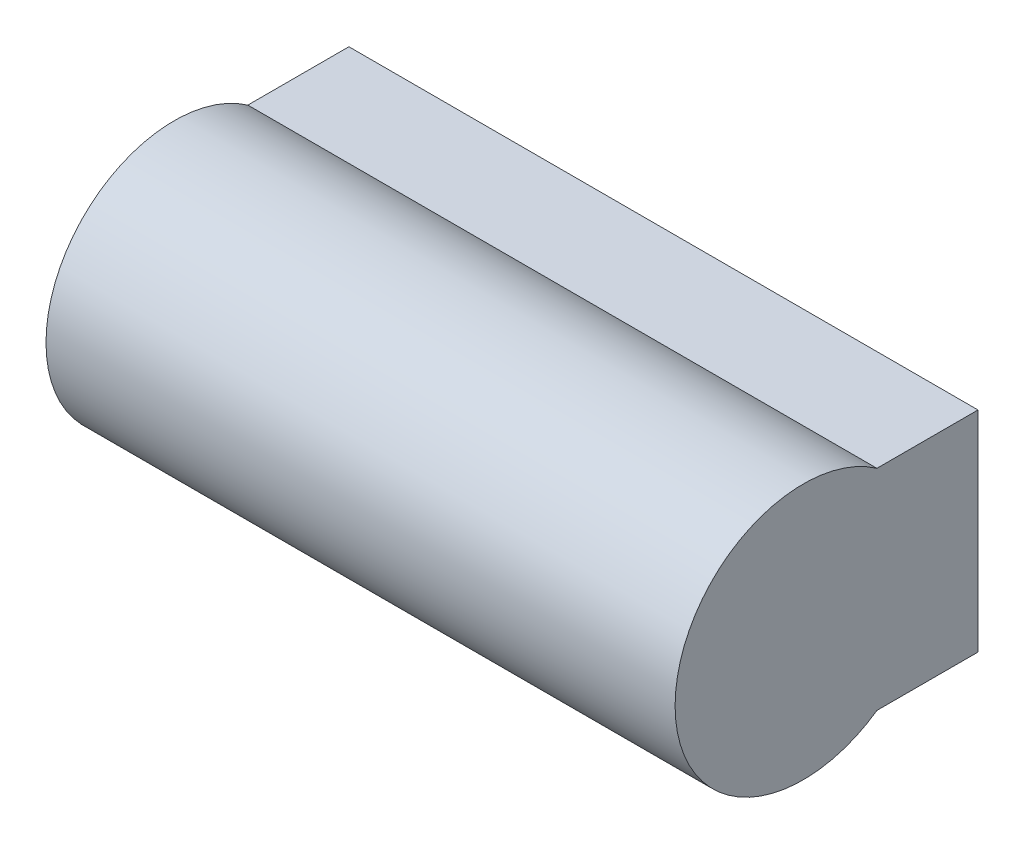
ISO-10303-21;
HEADER;
FILE_DESCRIPTION(('STEP AP214'),'2;1');
FILE_NAME('part.step','',(''),(''),'','','');
FILE_SCHEMA(('AUTOMOTIVE_DESIGN { 1 0 10303 214 1 1 1 1 }'));
ENDSEC;
DATA;
#1=APPLICATION_CONTEXT('core data for automotive mechanical design processes');
#2=APPLICATION_PROTOCOL_DEFINITION('international standard','automotive_design',2000,#1);
#3=PRODUCT_CONTEXT('',#1,'mechanical');
#4=PRODUCT('Part','Part','',(#3));
#5=PRODUCT_RELATED_PRODUCT_CATEGORY('part','',(#4));
#6=PRODUCT_DEFINITION_FORMATION('','',#4);
#7=PRODUCT_DEFINITION_CONTEXT('part definition',#1,'design');
#8=PRODUCT_DEFINITION('design','',#6,#7);
#9=PRODUCT_DEFINITION_SHAPE('','',#8);
#10=(LENGTH_UNIT() NAMED_UNIT(*) SI_UNIT(.MILLI.,.METRE.));
#11=(NAMED_UNIT(*) PLANE_ANGLE_UNIT() SI_UNIT($,.RADIAN.));
#12=(NAMED_UNIT(*) SI_UNIT($,.STERADIAN.) SOLID_ANGLE_UNIT());
#13=UNCERTAINTY_MEASURE_WITH_UNIT(LENGTH_MEASURE(1.E-05),#10,'distance_accuracy_value','');
#14=(GEOMETRIC_REPRESENTATION_CONTEXT(3) GLOBAL_UNCERTAINTY_ASSIGNED_CONTEXT((#13)) GLOBAL_UNIT_ASSIGNED_CONTEXT((#10,
#11,#12)) REPRESENTATION_CONTEXT('',''));
#15=CARTESIAN_POINT('',(0.,0.,0.));
#16=DIRECTION('',(0.,0.,1.));
#17=DIRECTION('',(1.,0.,0.));
#18=AXIS2_PLACEMENT_3D('',#15,#16,#17);
#19=CARTESIAN_POINT('',(21.,0.,7.5));
#20=DIRECTION('',(-1.,0.,0.));
#21=DIRECTION('',(0.,0.,1.));
#22=AXIS2_PLACEMENT_3D('',#19,#20,#21);
#23=CYLINDRICAL_SURFACE('',#22,5.5);
#24=DIRECTION('',(-1.,0.,0.));
#25=VECTOR('',#24,1.);
#26=CARTESIAN_POINT('',(21.,-4.5,4.33772233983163));
#27=LINE('',#26,#25);
#28=CARTESIAN_POINT('',(21.,-4.5,4.33772233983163));
#29=VERTEX_POINT('',#28);
#30=CARTESIAN_POINT('',(-6.,-4.5,4.33772233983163));
#31=VERTEX_POINT('',#30);
#32=EDGE_CURVE('E9',#29,#31,#27,.T.);
#33=ORIENTED_EDGE('',*,*,#32,.F.);
#34=CARTESIAN_POINT('',(21.,0.,7.5));
#35=DIRECTION('',(1.,0.,0.));
#36=DIRECTION('',(0.,0.,-1.));
#37=AXIS2_PLACEMENT_3D('',#34,#35,#36);
#38=CIRCLE('',#37,5.5);
#39=CARTESIAN_POINT('',(21.,4.5,4.33772233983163));
#40=VERTEX_POINT('',#39);
#41=EDGE_CURVE('E84',#40,#29,#38,.T.);
#42=ORIENTED_EDGE('',*,*,#41,.F.);
#43=DIRECTION('',(-1.,0.,0.));
#44=VECTOR('',#43,1.);
#45=CARTESIAN_POINT('',(21.,4.5,4.33772233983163));
#46=LINE('',#45,#44);
#47=CARTESIAN_POINT('',(-6.,4.5,4.33772233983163));
#48=VERTEX_POINT('',#47);
#49=EDGE_CURVE('E35',#40,#48,#46,.T.);
#50=ORIENTED_EDGE('',*,*,#49,.T.);
#51=CARTESIAN_POINT('',(-6.,0.,7.5));
#52=DIRECTION('',(1.,0.,0.));
#53=DIRECTION('',(0.,0.,-1.));
#54=AXIS2_PLACEMENT_3D('',#51,#52,#53);
#55=CIRCLE('',#54,5.5);
#56=EDGE_CURVE('E71',#48,#31,#55,.T.);
#57=ORIENTED_EDGE('',*,*,#56,.T.);
#58=EDGE_LOOP('',(#33,#42,#50,#57));
#59=FACE_BOUND('',#58,.T.);
#60=ADVANCED_FACE('F14',(#59),#23,.T.);
#61=CARTESIAN_POINT('',(21.,-4.5,4.33772233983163));
#62=DIRECTION('',(0.,1.,0.));
#63=DIRECTION('',(0.,0.,1.));
#64=AXIS2_PLACEMENT_3D('',#61,#62,#63);
#65=PLANE('',#64);
#66=DIRECTION('',(-1.,0.,0.));
#67=VECTOR('',#66,1.);
#68=CARTESIAN_POINT('',(21.,-4.5,0.));
#69=LINE('',#68,#67);
#70=CARTESIAN_POINT('',(21.,-4.5,0.));
#71=VERTEX_POINT('',#70);
#72=CARTESIAN_POINT('',(-6.,-4.5,0.));
#73=VERTEX_POINT('',#72);
#74=EDGE_CURVE('E28',#71,#73,#69,.T.);
#75=ORIENTED_EDGE('',*,*,#74,.F.);
#76=DIRECTION('',(0.,0.,-1.));
#77=VECTOR('',#76,1.);
#78=CARTESIAN_POINT('',(21.,-4.5,4.33772233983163));
#79=LINE('',#78,#77);
#80=EDGE_CURVE('E67',#29,#71,#79,.T.);
#81=ORIENTED_EDGE('',*,*,#80,.F.);
#82=ORIENTED_EDGE('',*,*,#32,.T.);
#83=DIRECTION('',(0.,0.,-1.));
#84=VECTOR('',#83,1.);
#85=CARTESIAN_POINT('',(-6.,-4.5,4.33772233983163));
#86=LINE('',#85,#84);
#87=EDGE_CURVE('E64',#31,#73,#86,.T.);
#88=ORIENTED_EDGE('',*,*,#87,.T.);
#89=EDGE_LOOP('',(#75,#81,#82,#88));
#90=FACE_BOUND('',#89,.T.);
#91=ADVANCED_FACE('F16',(#90),#65,.F.);
#92=CARTESIAN_POINT('',(21.,4.5,0.));
#93=DIRECTION('',(0.,0.,-1.));
#94=DIRECTION('',(0.,1.,0.));
#95=AXIS2_PLACEMENT_3D('',#92,#93,#94);
#96=PLANE('',#95);
#97=CARTESIAN_POINT('',(15.,0.,0.));
#98=DIRECTION('',(0.,0.,-1.));
#99=DIRECTION('',(0.,1.,0.));
#100=AXIS2_PLACEMENT_3D('',#97,#98,#99);
#101=CIRCLE('',#100,2.5);
#102=CARTESIAN_POINT('',(15.,2.5,0.));
#103=VERTEX_POINT('',#102);
#104=EDGE_CURVE('E151',#103,#103,#101,.T.);
#105=ORIENTED_EDGE('',*,*,#104,.F.);
#106=EDGE_LOOP('',(#105));
#107=FACE_BOUND('',#106,.T.);
#108=CARTESIAN_POINT('',(0.,0.,0.));
#109=DIRECTION('',(0.,0.,-1.));
#110=DIRECTION('',(0.,1.,0.));
#111=AXIS2_PLACEMENT_3D('',#108,#109,#110);
#112=CIRCLE('',#111,2.5);
#113=CARTESIAN_POINT('',(0.,2.5,0.));
#114=VERTEX_POINT('',#113);
#115=EDGE_CURVE('E74',#114,#114,#112,.T.);
#116=ORIENTED_EDGE('',*,*,#115,.F.);
#117=EDGE_LOOP('',(#116));
#118=FACE_BOUND('',#117,.T.);
#119=DIRECTION('',(-1.,0.,0.));
#120=VECTOR('',#119,1.);
#121=CARTESIAN_POINT('',(21.,4.5,0.));
#122=LINE('',#121,#120);
#123=CARTESIAN_POINT('',(21.,4.5,0.));
#124=VERTEX_POINT('',#123);
#125=CARTESIAN_POINT('',(-6.,4.5,0.));
#126=VERTEX_POINT('',#125);
#127=EDGE_CURVE('E43',#124,#126,#122,.T.);
#128=ORIENTED_EDGE('',*,*,#127,.F.);
#129=DIRECTION('',(0.,-1.,0.));
#130=VECTOR('',#129,1.);
#131=CARTESIAN_POINT('',(21.,4.5,0.));
#132=LINE('',#131,#130);
#133=EDGE_CURVE('E87',#124,#71,#132,.T.);
#134=ORIENTED_EDGE('',*,*,#133,.T.);
#135=ORIENTED_EDGE('',*,*,#74,.T.);
#136=DIRECTION('',(0.,-1.,0.));
#137=VECTOR('',#136,1.);
#138=CARTESIAN_POINT('',(-6.,4.5,0.));
#139=LINE('',#138,#137);
#140=EDGE_CURVE('E77',#126,#73,#139,.T.);
#141=ORIENTED_EDGE('',*,*,#140,.F.);
#142=EDGE_LOOP('',(#128,#134,#135,#141));
#143=FACE_BOUND('',#142,.T.);
#144=ADVANCED_FACE('F93',(#107,#118,#143),#96,.T.);
#145=CARTESIAN_POINT('',(21.,4.5,4.33772233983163));
#146=DIRECTION('',(0.,1.,0.));
#147=DIRECTION('',(1.,0.,0.));
#148=AXIS2_PLACEMENT_3D('',#145,#146,#147);
#149=PLANE('',#148);
#150=DIRECTION('',(0.,0.,-1.));
#151=VECTOR('',#150,1.);
#152=CARTESIAN_POINT('',(21.,4.5,4.33772233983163));
#153=LINE('',#152,#151);
#154=EDGE_CURVE('E89',#40,#124,#153,.T.);
#155=ORIENTED_EDGE('',*,*,#154,.T.);
#156=ORIENTED_EDGE('',*,*,#127,.T.);
#157=DIRECTION('',(0.,0.,-1.));
#158=VECTOR('',#157,1.);
#159=CARTESIAN_POINT('',(-6.,4.5,4.33772233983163));
#160=LINE('',#159,#158);
#161=EDGE_CURVE('E79',#48,#126,#160,.T.);
#162=ORIENTED_EDGE('',*,*,#161,.F.);
#163=ORIENTED_EDGE('',*,*,#49,.F.);
#164=EDGE_LOOP('',(#155,#156,#162,#163));
#165=FACE_BOUND('',#164,.T.);
#166=ADVANCED_FACE('F97',(#165),#149,.T.);
#167=CARTESIAN_POINT('',(21.,0.,7.5));
#168=DIRECTION('',(1.,0.,0.));
#169=DIRECTION('',(0.,0.,-1.));
#170=AXIS2_PLACEMENT_3D('',#167,#168,#169);
#171=PLANE('',#170);
#172=ORIENTED_EDGE('',*,*,#41,.T.);
#173=ORIENTED_EDGE('',*,*,#80,.T.);
#174=ORIENTED_EDGE('',*,*,#133,.F.);
#175=ORIENTED_EDGE('',*,*,#154,.F.);
#176=EDGE_LOOP('',(#172,#173,#174,#175));
#177=FACE_BOUND('',#176,.T.);
#178=ADVANCED_FACE('F95',(#177),#171,.T.);
#179=CARTESIAN_POINT('',(-6.,0.,7.5));
#180=DIRECTION('',(1.,0.,0.));
#181=DIRECTION('',(0.,0.,-1.));
#182=AXIS2_PLACEMENT_3D('',#179,#180,#181);
#183=PLANE('',#182);
#184=CARTESIAN_POINT('',(-6.,0.,7.5));
#185=DIRECTION('',(-1.,0.,0.));
#186=DIRECTION('',(0.,0.,1.));
#187=AXIS2_PLACEMENT_3D('',#184,#185,#186);
#188=CIRCLE('',#187,4.);
#189=CARTESIAN_POINT('',(-6.,0.,11.5));
#190=VERTEX_POINT('',#189);
#191=EDGE_CURVE('E143',#190,#190,#188,.T.);
#192=ORIENTED_EDGE('',*,*,#191,.F.);
#193=EDGE_LOOP('',(#192));
#194=FACE_BOUND('',#193,.T.);
#195=ORIENTED_EDGE('',*,*,#56,.F.);
#196=ORIENTED_EDGE('',*,*,#161,.T.);
#197=ORIENTED_EDGE('',*,*,#140,.T.);
#198=ORIENTED_EDGE('',*,*,#87,.F.);
#199=EDGE_LOOP('',(#195,#196,#197,#198));
#200=FACE_BOUND('',#199,.T.);
#201=ADVANCED_FACE('F76',(#194,#200),#183,.F.);
#202=CARTESIAN_POINT('',(0.,0.,9.));
#203=DIRECTION('',(0.,0.,-1.));
#204=DIRECTION('',(0.,1.,0.));
#205=AXIS2_PLACEMENT_3D('',#202,#203,#204);
#206=CYLINDRICAL_SURFACE('',#205,2.5);
#207=CARTESIAN_POINT('',(0.,2.49999999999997,4.37750100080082));
#208=CARTESIAN_POINT('',(-0.0621567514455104,2.49999941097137,4.37750008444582));
#209=CARTESIAN_POINT('',(-0.124325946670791,2.49767581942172,4.37563509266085));
#210=CARTESIAN_POINT('',(-0.248117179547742,2.48843349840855,4.36827076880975));
#211=CARTESIAN_POINT('',(-0.309738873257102,2.48151206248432,4.36276929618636));
#212=CARTESIAN_POINT('',(-0.493226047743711,2.45397595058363,4.34111046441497));
#213=CARTESIAN_POINT('',(-0.61354833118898,2.42658990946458,4.3197996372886));
#214=CARTESIAN_POINT('',(-0.845598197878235,2.35576217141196,4.26700229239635));
#215=CARTESIAN_POINT('',(-0.9573904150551,2.31245961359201,4.23560424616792));
#216=CARTESIAN_POINT('',(-1.17200852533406,2.21143916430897,4.16633999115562));
#217=CARTESIAN_POINT('',(-1.27483417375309,2.15372087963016,4.12847360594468));
#218=CARTESIAN_POINT('',(-1.48373398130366,2.01647682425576,4.04440774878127));
#219=CARTESIAN_POINT('',(-1.58839332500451,1.93506425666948,3.99777185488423));
#220=CARTESIAN_POINT('',(-1.78376155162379,1.75662526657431,3.90494496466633));
#221=CARTESIAN_POINT('',(-1.87445827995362,1.65958538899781,3.85875438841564));
#222=CARTESIAN_POINT('',(-2.05022029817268,1.43833990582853,3.76540475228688));
#223=CARTESIAN_POINT('',(-2.13328618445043,1.31226934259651,3.71880112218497));
#224=CARTESIAN_POINT('',(-2.24054515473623,1.11163395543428,3.65692748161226));
#225=CARTESIAN_POINT('',(-2.27341513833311,1.04281240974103,3.63763716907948));
#226=CARTESIAN_POINT('',(-2.33295468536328,0.901758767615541,3.60229563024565));
#227=CARTESIAN_POINT('',(-2.35962853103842,0.829529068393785,3.58624216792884));
#228=CARTESIAN_POINT('',(-2.40398381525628,0.689700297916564,3.55933240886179));
#229=CARTESIAN_POINT('',(-2.42230197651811,0.622371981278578,3.54811464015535));
#230=CARTESIAN_POINT('',(-2.45330228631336,0.485997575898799,3.52903758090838));
#231=CARTESIAN_POINT('',(-2.46598768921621,0.416952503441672,3.52117635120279));
#232=CARTESIAN_POINT('',(-2.48551379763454,0.277765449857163,3.50904529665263));
#233=CARTESIAN_POINT('',(-2.49235811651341,0.207624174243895,3.50477325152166));
#234=CARTESIAN_POINT('',(-2.50009921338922,0.066911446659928,3.49993874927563));
#235=CARTESIAN_POINT('',(-2.50099667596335,-0.00365995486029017,3.49937586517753));
#236=CARTESIAN_POINT('',(-2.49527462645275,-0.196045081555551,3.50295520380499));
#237=CARTESIAN_POINT('',(-2.48269349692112,-0.317681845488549,3.51082959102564));
#238=CARTESIAN_POINT('',(-2.44026978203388,-0.556636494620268,3.53709096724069));
#239=CARTESIAN_POINT('',(-2.41042589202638,-0.673954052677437,3.55547875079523));
#240=CARTESIAN_POINT('',(-2.33479144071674,-0.90177199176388,3.60123829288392));
#241=CARTESIAN_POINT('',(-2.28896008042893,-1.01225407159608,3.62863302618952));
#242=CARTESIAN_POINT('',(-2.18306276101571,-1.22404012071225,3.69028708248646));
#243=CARTESIAN_POINT('',(-2.12299355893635,-1.32534199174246,3.72454796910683));
#244=CARTESIAN_POINT('',(-1.98194358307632,-1.5294264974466,3.80213558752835));
#245=CARTESIAN_POINT('',(-1.89929072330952,-1.63082454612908,3.84605993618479));
#246=CARTESIAN_POINT('',(-1.71973526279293,-1.81919733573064,3.93609072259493));
#247=CARTESIAN_POINT('',(-1.62281195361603,-1.90615071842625,3.98220026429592));
#248=CARTESIAN_POINT('',(-1.40258874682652,-2.0747088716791,4.07857116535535));
#249=CARTESIAN_POINT('',(-1.27749723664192,-2.15413229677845,4.12858837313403));
#250=CARTESIAN_POINT('',(-1.01270776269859,-2.29052307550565,4.21971721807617));
#251=CARTESIAN_POINT('',(-0.873037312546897,-2.34753179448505,4.2608451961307));
#252=CARTESIAN_POINT('',(-0.620461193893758,-2.42437133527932,4.31816246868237));
#253=CARTESIAN_POINT('',(-0.510178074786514,-2.45003683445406,4.33806591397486));
#254=CARTESIAN_POINT('',(-0.285769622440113,-2.48620337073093,4.36641722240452));
#255=CARTESIAN_POINT('',(-0.171649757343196,-2.49672512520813,4.37488073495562));
#256=CARTESIAN_POINT('',(0.0574573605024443,-2.50197072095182,4.37907732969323));
#257=CARTESIAN_POINT('',(0.17244600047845,-2.49665835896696,4.37478123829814));
#258=CARTESIAN_POINT('',(0.399561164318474,-2.47051466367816,4.35407914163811));
#259=CARTESIAN_POINT('',(0.511685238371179,-2.44967047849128,4.33766310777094));
#260=CARTESIAN_POINT('',(0.728436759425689,-2.3940987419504,4.29539879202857));
#261=CARTESIAN_POINT('',(0.833157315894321,-2.35960571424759,4.26971045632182));
#262=CARTESIAN_POINT('',(1.03557469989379,-2.27804893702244,4.2116885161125));
#263=CARTESIAN_POINT('',(1.13326901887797,-2.23098072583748,4.17935255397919));
#264=CARTESIAN_POINT('',(1.33861194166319,-2.11530798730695,4.10425598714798));
#265=CARTESIAN_POINT('',(1.44461452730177,-2.04430931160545,4.06068275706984));
#266=CARTESIAN_POINT('',(1.64437066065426,-1.88737868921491,3.97212056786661));
#267=CARTESIAN_POINT('',(1.73811132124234,-1.8014312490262,3.92713017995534));
#268=CARTESIAN_POINT('',(1.92596407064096,-1.60076932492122,3.83233790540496));
#269=CARTESIAN_POINT('',(2.0177273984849,-1.48365201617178,3.78292066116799));
#270=CARTESIAN_POINT('',(2.18014701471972,-1.23256787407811,3.69231026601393));
#271=CARTESIAN_POINT('',(2.25081319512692,-1.09860897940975,3.65111326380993));
#272=CARTESIAN_POINT('',(2.33658106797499,-0.891930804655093,3.60011033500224));
#273=CARTESIAN_POINT('',(2.36129744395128,-0.824318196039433,3.58522944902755));
#274=CARTESIAN_POINT('',(2.40493827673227,-0.686640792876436,3.55875356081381));
#275=CARTESIAN_POINT('',(2.42386608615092,-0.616577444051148,3.54715665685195));
#276=CARTESIAN_POINT('',(2.45560583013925,-0.474639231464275,3.5276148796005));
#277=CARTESIAN_POINT('',(2.46842309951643,-0.402766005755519,3.51966682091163));
#278=CARTESIAN_POINT('',(2.48773917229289,-0.257881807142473,3.50765831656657));
#279=CARTESIAN_POINT('',(2.49423902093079,-0.184871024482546,3.50359722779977));
#280=CARTESIAN_POINT('',(2.50307151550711,0.0131102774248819,3.49808478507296));
#281=CARTESIAN_POINT('',(2.49926579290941,0.138539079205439,3.50047293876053));
#282=CARTESIAN_POINT('',(2.47308241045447,0.38658313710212,3.51678024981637));
#283=CARTESIAN_POINT('',(2.45070559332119,0.509198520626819,3.53069888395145));
#284=CARTESIAN_POINT('',(2.38967758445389,0.744080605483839,3.56807916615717));
#285=CARTESIAN_POINT('',(2.35161792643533,0.856558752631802,3.59119298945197));
#286=CARTESIAN_POINT('',(2.26088053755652,1.07343034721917,3.64510028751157));
#287=CARTESIAN_POINT('',(2.2082003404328,1.17782242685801,3.67589505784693));
#288=CARTESIAN_POINT('',(2.08367872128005,1.38731297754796,3.74649326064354));
#289=CARTESIAN_POINT('',(2.0104160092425,1.49136012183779,3.78689998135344));
#290=CARTESIAN_POINT('',(1.84984676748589,1.68643334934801,3.87132716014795));
#291=CARTESIAN_POINT('',(1.76252439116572,1.7774445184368,3.91535166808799));
#292=CARTESIAN_POINT('',(1.56176748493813,1.95744716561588,4.00999171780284));
#293=CARTESIAN_POINT('',(1.44638338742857,2.04425661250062,4.06064261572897));
#294=CARTESIAN_POINT('',(1.20071059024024,2.19754648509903,4.15650352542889));
#295=CARTESIAN_POINT('',(1.07043018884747,2.26403815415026,4.20171653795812));
#296=CARTESIAN_POINT('',(0.827194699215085,2.36198229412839,4.27140460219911));
#297=CARTESIAN_POINT('',(0.71672942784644,2.39792458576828,4.29825360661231));
#298=CARTESIAN_POINT('',(0.490060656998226,2.45425618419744,4.34121641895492));
#299=CARTESIAN_POINT('',(0.373876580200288,2.47469472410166,4.35736418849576));
#300=CARTESIAN_POINT('',(0.213940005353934,2.4911984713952,4.37047142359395));
#301=CARTESIAN_POINT('',(0.171274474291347,2.49449433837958,4.37310005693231));
#302=CARTESIAN_POINT('',(0.085741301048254,2.49889558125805,4.37661538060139));
#303=CARTESIAN_POINT('',(0.0428736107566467,2.50000040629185,4.37750163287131));
#304=CARTESIAN_POINT('',(0.,2.49999999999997,4.37750100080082));
#305=B_SPLINE_CURVE_WITH_KNOTS('',3,(#207,#208,#209,#210,#211,#212,#213,#214,#215,#216,#217,
#218,#219,#220,#221,#222,#223,#224,#225,#226,#227,#228,#229,#230,#231,#232,#233,#234,#235,#236,
#237,#238,#239,#240,#241,#242,#243,#244,#245,#246,#247,#248,#249,#250,#251,#252,#253,#254,#255,
#256,#257,#258,#259,#260,#261,#262,#263,#264,#265,#266,#267,#268,#269,#270,#271,#272,#273,#274,
#275,#276,#277,#278,#279,#280,#281,#282,#283,#284,#285,#286,#287,#288,#289,#290,#291,#292,#293,
#294,#295,#296,#297,#298,#299,#300,#301,#302,#303,#304),.UNSPECIFIED.,.T.,.F.,(4,2,2,2,2,2,2,2,
2,2,2,2,2,2,2,2,2,2,2,2,2,2,2,2,2,2,2,2,2,2,2,2,2,2,2,2,2,2,2,2,2,2,2,2,2,2,2,2,4),(0.,
0.18641531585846,0.372940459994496,0.746478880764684,1.11682668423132,1.48718459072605,
1.9072279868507,2.32763499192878,2.79876029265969,3.03445880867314,3.26999394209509,
3.48170145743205,3.69328649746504,3.90474055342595,4.11617026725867,4.48184709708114,
4.84755156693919,5.21419620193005,5.58092442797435,5.99329080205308,6.40626158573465,
6.87316206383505,7.33919680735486,7.68265621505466,8.02564530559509,8.36941921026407,
8.7134778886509,9.05186495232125,9.390372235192,9.79332737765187,10.1967026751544,
10.6647326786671,11.1325428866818,11.3527929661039,11.5729152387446,11.7928449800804,
12.0127383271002,12.3871595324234,12.7615637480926,13.1229788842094,13.4844550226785,
13.8834503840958,14.2828986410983,14.7399238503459,15.1966956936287,15.5530255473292,
15.9082190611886,16.0367696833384,16.1653526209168),.UNSPECIFIED.);
#306=CARTESIAN_POINT('',(0.,2.49999999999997,4.37750100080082));
#307=VERTEX_POINT('',#306);
#308=EDGE_CURVE('E18',#307,#307,#305,.T.);
#309=ORIENTED_EDGE('',*,*,#308,.T.);
#310=EDGE_LOOP('',(#309));
#311=FACE_BOUND('',#310,.T.);
#312=ORIENTED_EDGE('',*,*,#115,.T.);
#313=EDGE_LOOP('',(#312));
#314=FACE_BOUND('',#313,.T.);
#315=ADVANCED_FACE('F110',(#311,#314),#206,.F.);
#316=CARTESIAN_POINT('',(15.,0.,9.));
#317=DIRECTION('',(0.,0.,-1.));
#318=DIRECTION('',(0.,1.,0.));
#319=AXIS2_PLACEMENT_3D('',#316,#317,#318);
#320=CYLINDRICAL_SURFACE('',#319,2.5);
#321=CARTESIAN_POINT('',(15.,0.,6.));
#322=DIRECTION('',(0.,0.,-1.));
#323=DIRECTION('',(0.,1.,0.));
#324=AXIS2_PLACEMENT_3D('',#321,#322,#323);
#325=CIRCLE('',#324,2.5);
#326=CARTESIAN_POINT('',(15.,2.49999999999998,6.00000000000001));
#327=VERTEX_POINT('',#326);
#328=EDGE_CURVE('E142',#327,#327,#325,.T.);
#329=ORIENTED_EDGE('',*,*,#328,.F.);
#330=EDGE_LOOP('',(#329));
#331=FACE_BOUND('',#330,.T.);
#332=ORIENTED_EDGE('',*,*,#104,.T.);
#333=EDGE_LOOP('',(#332));
#334=FACE_BOUND('',#333,.T.);
#335=ADVANCED_FACE('F121',(#331,#334),#320,.F.);
#336=CARTESIAN_POINT('',(8.,0.,7.5));
#337=DIRECTION('',(-1.,0.,0.));
#338=DIRECTION('',(0.,0.,1.));
#339=AXIS2_PLACEMENT_3D('',#336,#337,#338);
#340=CYLINDRICAL_SURFACE('',#339,4.);
#341=ORIENTED_EDGE('',*,*,#191,.T.);
#342=EDGE_LOOP('',(#341));
#343=FACE_BOUND('',#342,.T.);
#344=CARTESIAN_POINT('',(8.,0.,7.5));
#345=DIRECTION('',(-1.,0.,0.));
#346=DIRECTION('',(0.,0.,1.));
#347=AXIS2_PLACEMENT_3D('',#344,#345,#346);
#348=CIRCLE('',#347,4.);
#349=CARTESIAN_POINT('',(8.,0.,11.5));
#350=VERTEX_POINT('',#349);
#351=EDGE_CURVE('E146',#350,#350,#348,.T.);
#352=ORIENTED_EDGE('',*,*,#351,.F.);
#353=EDGE_LOOP('',(#352));
#354=FACE_BOUND('',#353,.T.);
#355=ORIENTED_EDGE('',*,*,#308,.F.);
#356=EDGE_LOOP('',(#355));
#357=FACE_BOUND('',#356,.T.);
#358=ADVANCED_FACE('F124',(#343,#354,#357),#340,.F.);
#359=CARTESIAN_POINT('',(8.,0.,7.5));
#360=DIRECTION('',(-1.,0.,0.));
#361=DIRECTION('',(0.,0.,1.));
#362=AXIS2_PLACEMENT_3D('',#359,#360,#361);
#363=PLANE('',#362);
#364=ORIENTED_EDGE('',*,*,#351,.T.);
#365=EDGE_LOOP('',(#364));
#366=FACE_BOUND('',#365,.T.);
#367=ADVANCED_FACE('F129',(#366),#363,.T.);
#368=CARTESIAN_POINT('',(15.,0.,6.));
#369=DIRECTION('',(0.,0.,-1.));
#370=DIRECTION('',(0.,1.,0.));
#371=AXIS2_PLACEMENT_3D('',#368,#369,#370);
#372=PLANE('',#371);
#373=ORIENTED_EDGE('',*,*,#328,.T.);
#374=EDGE_LOOP('',(#373));
#375=FACE_BOUND('',#374,.T.);
#376=ADVANCED_FACE('F133',(#375),#372,.T.);
#377=CLOSED_SHELL('',(#60,#91,#144,#166,#178,#201,#315,#335,#358,#367,#376));
#378=MANIFOLD_SOLID_BREP('B1',#377);
#379=ADVANCED_BREP_SHAPE_REPRESENTATION('',(#18,#378),#14);
#380=SHAPE_DEFINITION_REPRESENTATION(#9,#379);
ENDSEC;
END-ISO-10303-21;
